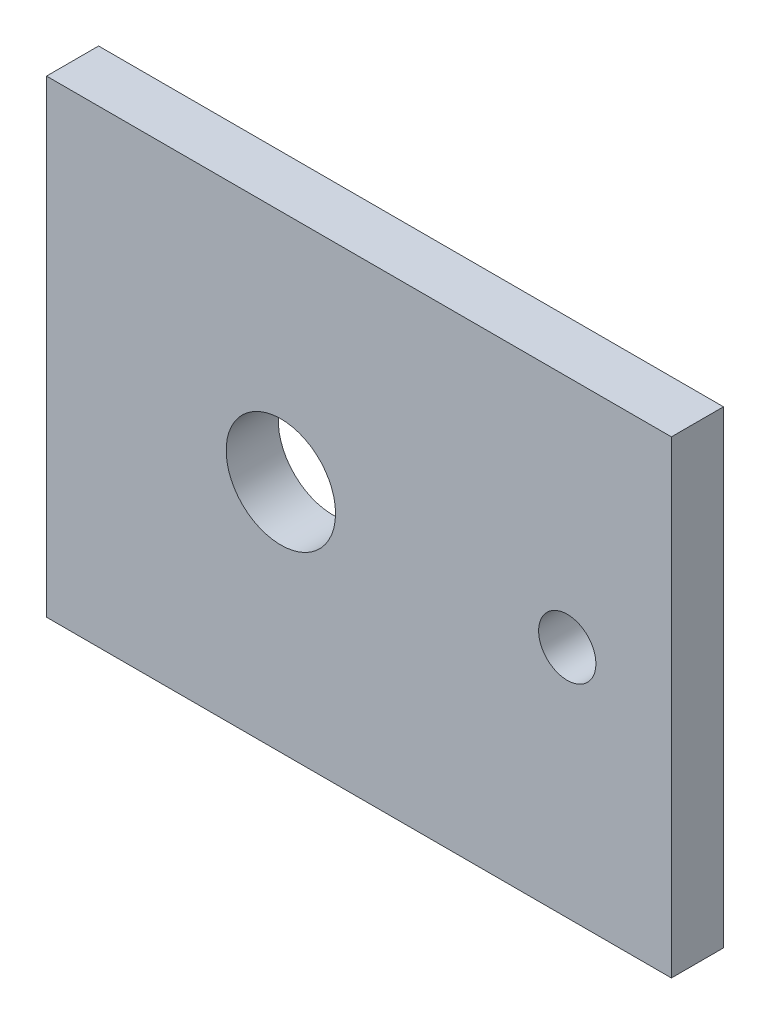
from build123d import *

# Parameters (mm, degrees)
ESQUISSE1_W             = 120
ESQUISSE1_H             = 90
EXTRUSION1_DEPTH        = 10
ESQUISSE6_R             = 5.5
ENL_V_MAT_EXTRU_2_DEPTH = 151.332963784
ESQUISSE4_R             = 10.5
ENL_V_MAT_EXTRU_3_DEPTH = 151.332963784


with BuildPart() as part:
    # Esquisse1 → Extrusion1 (new body)
    with BuildSketch(Plane.XY):
        with Locations((60, 45)):
            Rectangle(ESQUISSE1_W, ESQUISSE1_H)
    extrude(amount=EXTRUSION1_DEPTH)

    # Esquisse6 → Enl_v. mat.-Extru.2 (cut, through all)
    with BuildSketch(Plane.XY.offset(10)):
        with Locations((100, 45)):
            Circle(ESQUISSE6_R)
    extrude(amount=-ENL_V_MAT_EXTRU_2_DEPTH, mode=Mode.SUBTRACT)

    # Esquisse4 → Enl_v. mat.-Extru.3 (cut, through all)
    with BuildSketch(Plane.XY.offset(10)):
        with Locations((45, 45)):
            Circle(ESQUISSE4_R)
    extrude(amount=-ENL_V_MAT_EXTRU_3_DEPTH, mode=Mode.SUBTRACT)


solid = part.part
